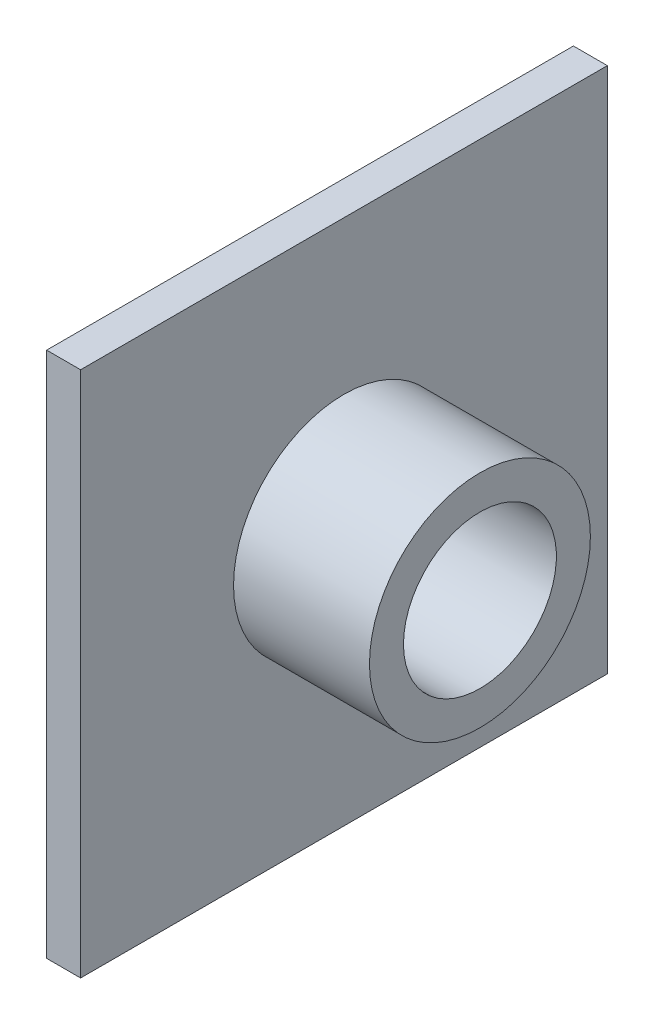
from build123d import *

# Parameters (mm, degrees)
ESQUISSE2_W             = 62
ESQUISSE2_H             = 62
BOSS_EXTRU_1_DEPTH      = 4
ESQUISSE3_R             = 13
BOSS_EXTRU_2_DEPTH      = 20
ESQUISSE4_R             = 9
ENL_V_MAT_EXTRU_1_DEPTH = 49.187135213


with BuildPart() as part:
    # Esquisse2 → Boss.-Extru.1 (new body)
    with BuildSketch(Plane(origin=(0, 0, 0), x_dir=(0, 0, -1), z_dir=(1, 0, 0))):
        Rectangle(ESQUISSE2_W, ESQUISSE2_H)
    extrude(amount=BOSS_EXTRU_1_DEPTH)

    # Esquisse3 → Boss.-Extru.2 (add)
    with BuildSketch(Plane.ZY):
        Circle(ESQUISSE3_R)
    extrude(amount=-BOSS_EXTRU_2_DEPTH)

    # Esquisse4 → Enl_v. mat.-Extru.1 (cut, through all)
    with BuildSketch(Plane.ZY):
        Circle(ESQUISSE4_R)
    extrude(amount=-ENL_V_MAT_EXTRU_1_DEPTH, mode=Mode.SUBTRACT)


solid = part.part
